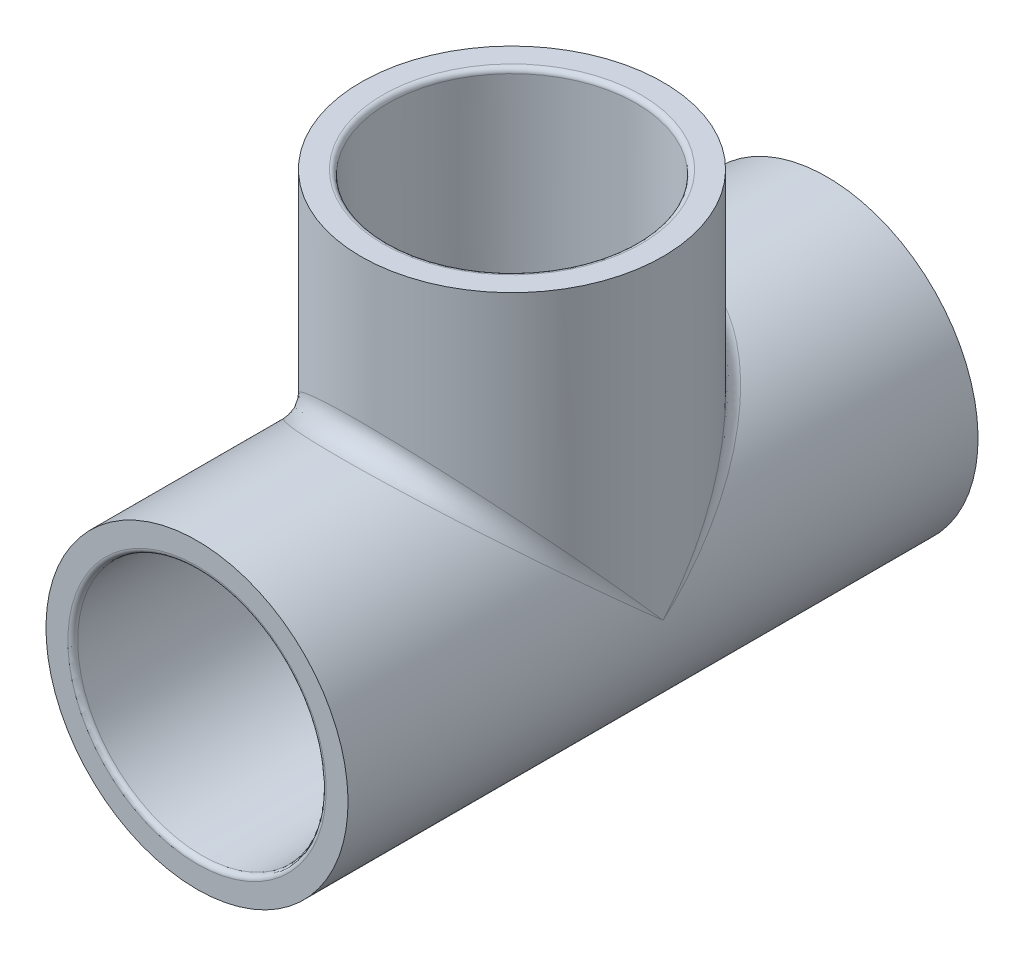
from build123d import *

# Parameters (mm, degrees)
FILLET1_R = 0.5238750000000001
FILLET2_R = 0.6730999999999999
FILLET3_R = 2.79654


with BuildPart() as part:
    # Sketch3 → Revolve1 (revolve)
    with BuildSketch(Plane(origin=(0, 0, 0), x_dir=(0, 0, -1), z_dir=(1, 0, 0))):
        Polygon((-42.672, 0), (42.672, -4.7e-16), (42.672, -20.459699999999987), (-42.67199999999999, -20.459699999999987), align=None)
    revolve(axis=Axis((0, 0, 42.672), (0, -1e-17, -1)))

    # Sketch4 → Revolve2 (revolve)
    with BuildSketch(Plane(origin=(0, 0, 0), x_dir=(0, 0, -1), z_dir=(1, 0, 0)), mode=Mode.PRIVATE) as revolve2_sk:
        Polygon((0, 42.67199999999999), (20.459699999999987, 42.67199999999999), (20.45969999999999, 0), (0, 0), align=None)
    revolve(revolve2_sk.sketch.rotate(Axis((0, 42.67199999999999, 0), (0, -1, 0)), 180), axis=Axis((0, 42.67199999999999, 0), (0, -1, 0)))

    # Sketch5 → Cut-Revolve1 (revolve, cut)
    with BuildSketch(Plane(origin=(0, 0, 0), x_dir=(0, 0, -1), z_dir=(1, 0, 0))):
        Polygon((-18.03399999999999, -15.760700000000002), (18.033999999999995, -15.760699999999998), (18.034, -16.636999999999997), (42.672, -16.82749999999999), (42.672, 1.045e-14), (-42.672, 0), (-42.672, -16.827499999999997), (-18.033999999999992, -16.637), align=None)
    revolve(axis=Axis((0, 0, 42.672), (0, 1.2e-16, -1)), mode=Mode.SUBTRACT)

    # Sketch6 → Cut-Revolve2 (revolve, cut)
    with BuildSketch(Plane(origin=(0, 0, 0), x_dir=(0, 0, -1), z_dir=(1, 0, 0))):
        Polygon((14.5415, 0), (14.5415, 18.03399999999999), (16.637, 18.03399999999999), (16.827499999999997, 42.67199999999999), (0, 42.67199999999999), (0, 0), align=None)
    revolve(axis=Axis((0, 0, 0), (0, 1, 0)), mode=Mode.SUBTRACT)

    # Fillet1
    fillet1_edges = [part.edges().sort_by_distance(p)[0] for p in [
        (-2.04e-15, 16.637000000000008, 18.034),
        (-2.04e-15, 16.63700000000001, -18.033999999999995),
        (-2.04e-15, 18.03399999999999, 16.637),
    ]]
    fillet(fillet1_edges, radius=FILLET1_R)

    # Fillet2
    fillet2_edges = [part.edges().sort_by_distance(p)[0] for p in [
        (-2.06e-15, 16.827499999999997, 42.672),
        (-2.06e-15, 16.82750000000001, -42.672),
        (-2.06e-15, 42.67199999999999, 16.827499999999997),
    ]]
    fillet(fillet2_edges, radius=FILLET2_R)

    # Fillet3
    fillet3_edges = [part.edges().sort_by_distance(p)[0] for p in [
        (-15.616807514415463, 13.217966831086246, 13.217966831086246),
        (-2.254757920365e-05, 20.45969999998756, -20.45969999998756),
    ]]
    fillet(fillet3_edges, radius=FILLET3_R)


solid = part.part
